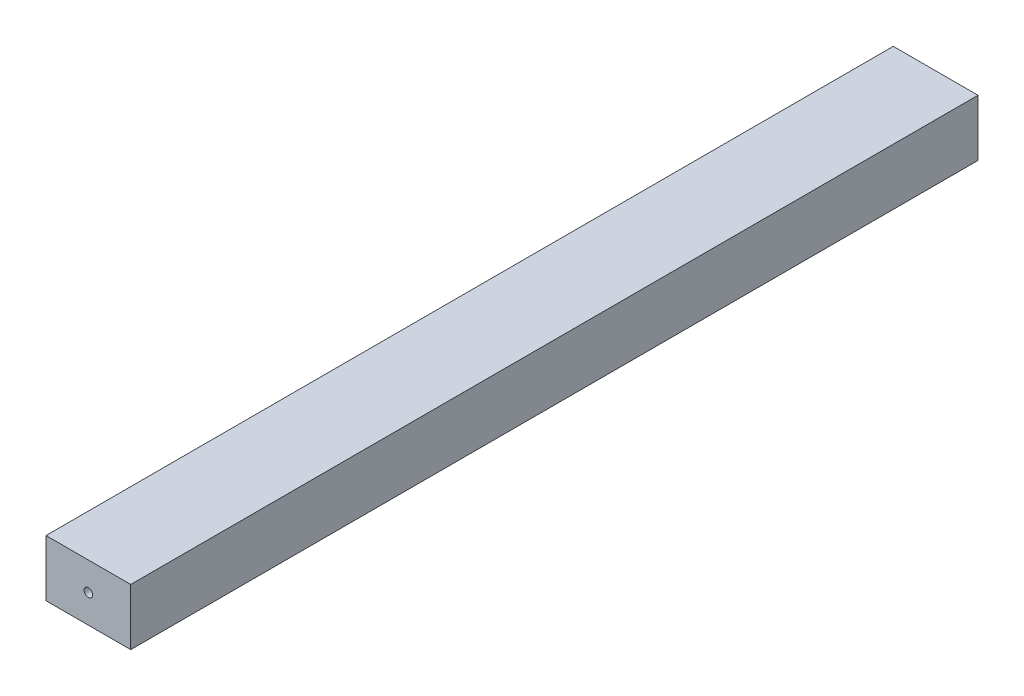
from build123d import *

# Parameters (mm, degrees)
ESQUISSE1_W        = 60
ESQUISSE1_H        = 40
ESQUISSE1_R        = 3
BOSS_EXTRU_1_DEPTH = 600


with BuildPart() as part:
    # Esquisse1 → Boss.-Extru.1 (new body)
    with BuildSketch(Plane.XY):
        Rectangle(ESQUISSE1_W, ESQUISSE1_H)
        Circle(ESQUISSE1_R, mode=Mode.SUBTRACT)
    extrude(amount=BOSS_EXTRU_1_DEPTH)


solid = part.part
